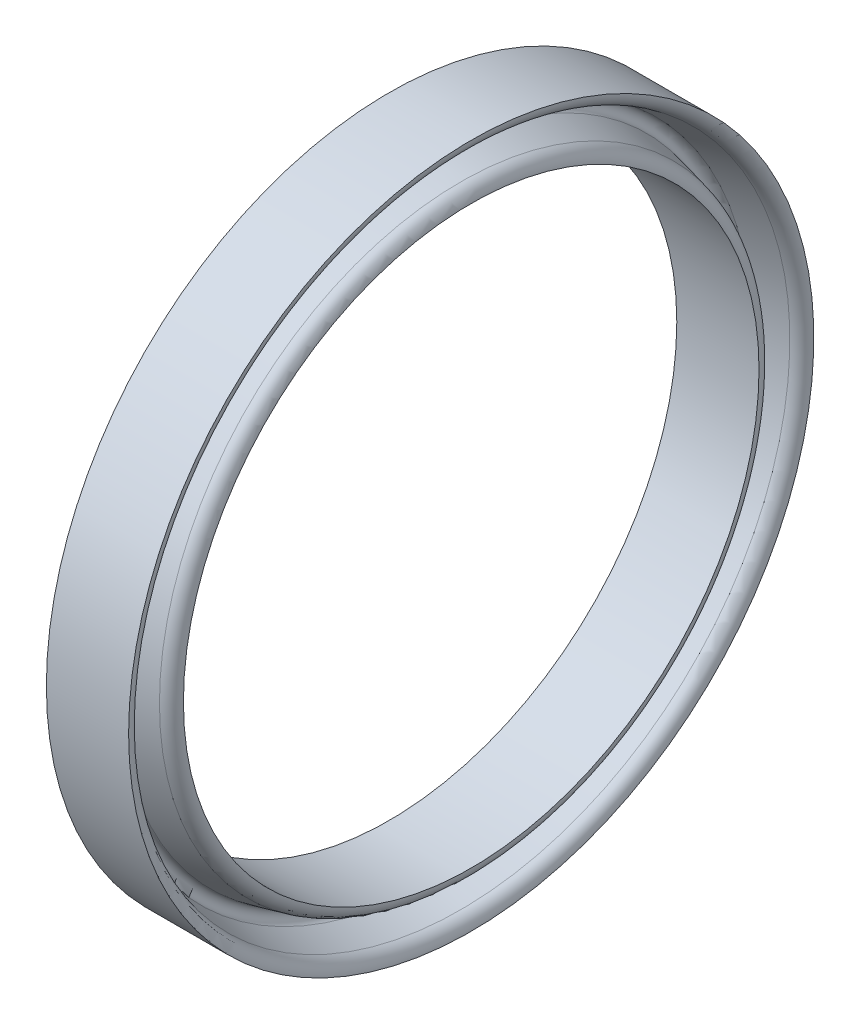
from build123d import *


with BuildPart() as part:
    # Esquisse1 → BASE (revolve)
    with BuildSketch(Plane.XY, mode=Mode.PRIVATE) as base_sk:
        with BuildLine():
            Line((0, 21), (6, 21))
            ThreePointArc((6, 21), (5.782457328, 21.622704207), (5.22447894, 21.97447894))
            Line((5.22447894, 21.97447894), (2.88776053, 22.51276053))
            ThreePointArc((2.88776053, 22.51276053), (2.5, 23), (2.88776053, 23.48723947))
            Line((2.88776053, 23.48723947), (5.22447894, 24.02552106))
            ThreePointArc((5.22447894, 24.02552106), (5.782457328, 24.377295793), (6, 25))
            Line((6, 25), (0, 25))
            Line((0, 25), (0, 21))
        make_face()
    revolve(base_sk.sketch.rotate(Axis((0, 0, 0), (1, 0, 0)), 90), axis=Axis((0, 0, 0), (1, 0, 0)))


solid = part.part
